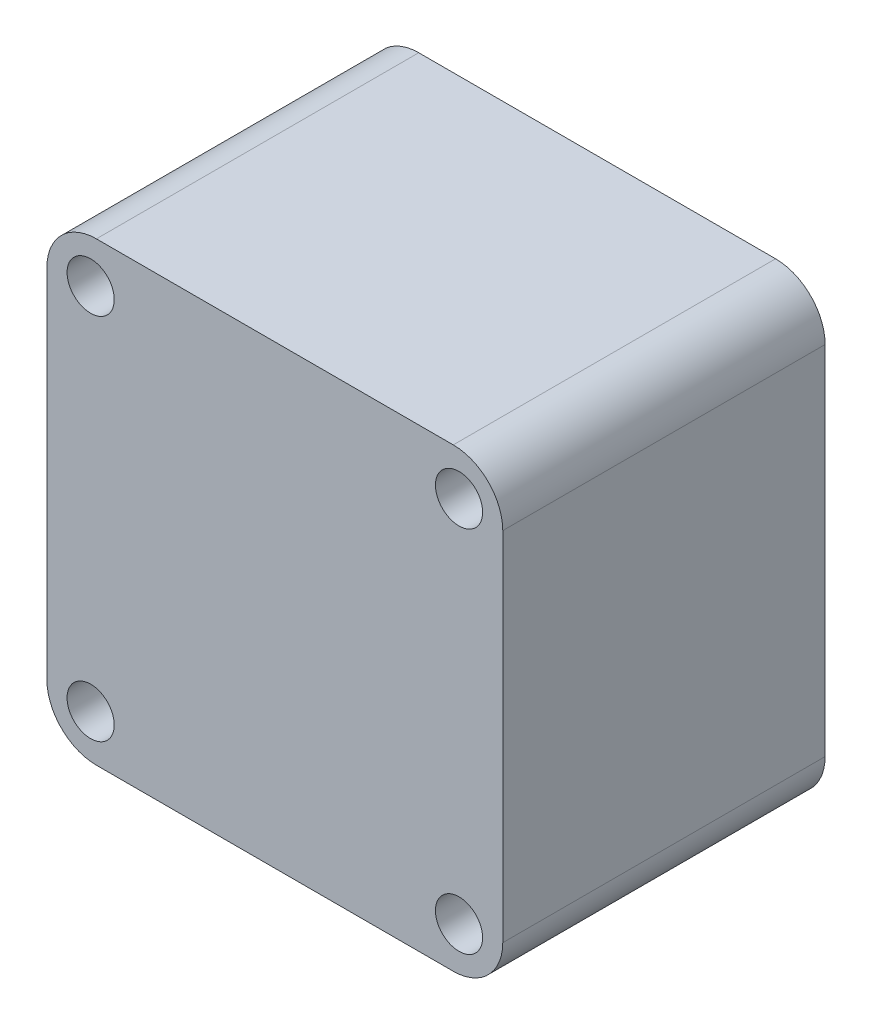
from build123d import *

# Parameters (mm, degrees)
BOSS_EXTRUDE4_DEPTH = 28


with BuildPart() as part:
    # Sketch2 → Boss-Extrude4 (new body)
    with BuildSketch(Plane.XY):
        with BuildLine():
            Line((688.97068901, 851.834893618), (688.97068901, 853.587694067))
            Line((688.97068901, 853.587694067), (688.97068901, 856.187694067))
            Line((688.97068901, 856.187694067), (688.97068901, 859.287694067))
            Line((688.97068901, 859.287694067), (688.97068901, 879.587694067))
            ThreePointArc((688.97068901, 879.587694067), (687.711248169, 882.628253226), (684.67068901, 883.887694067))
            Line((684.67068901, 883.887694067), (653.67068901, 883.887694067))
            ThreePointArc((653.67068901, 883.887694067), (650.630129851, 882.628253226), (649.37068901, 879.587694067))
            Line((649.37068901, 879.587694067), (649.37068901, 848.587694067))
            ThreePointArc((649.37068901, 848.587694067), (650.630129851, 845.547134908), (653.67068901, 844.287694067))
            Line((653.67068901, 844.287694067), (684.67068901, 844.287694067))
            ThreePointArc((684.67068901, 844.287694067), (687.711248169, 845.547134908), (688.97068901, 848.587694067))
            Line((688.97068901, 848.587694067), (688.97068901, 851.834893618))
        make_face()
        with BuildLine():
            ThreePointArc((655.22068901, 848.087694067), (653.17068901, 846.037694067), (651.12068901, 848.087694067))
            ThreePointArc((651.12068901, 848.087694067), (653.17068901, 850.137694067), (655.22068901, 848.087694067))
        make_face(mode=Mode.SUBTRACT)
        with BuildLine():
            ThreePointArc((687.22068901, 848.087694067), (685.17068901, 846.037694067), (683.12068901, 848.087694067))
            ThreePointArc((683.12068901, 848.087694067), (685.17068901, 850.137694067), (687.22068901, 848.087694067))
        make_face(mode=Mode.SUBTRACT)
        with BuildLine():
            ThreePointArc((655.22068901, 880.087694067), (653.17068901, 878.037694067), (651.12068901, 880.087694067))
            ThreePointArc((651.12068901, 880.087694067), (653.17068901, 882.137694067), (655.22068901, 880.087694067))
        make_face(mode=Mode.SUBTRACT)
        with BuildLine():
            ThreePointArc((687.22068901, 880.087694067), (685.17068901, 878.037694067), (683.12068901, 880.087694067))
            ThreePointArc((683.12068901, 880.087694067), (685.17068901, 882.137694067), (687.22068901, 880.087694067))
        make_face(mode=Mode.SUBTRACT)
    extrude(amount=-BOSS_EXTRUDE4_DEPTH)


solid = part.part
